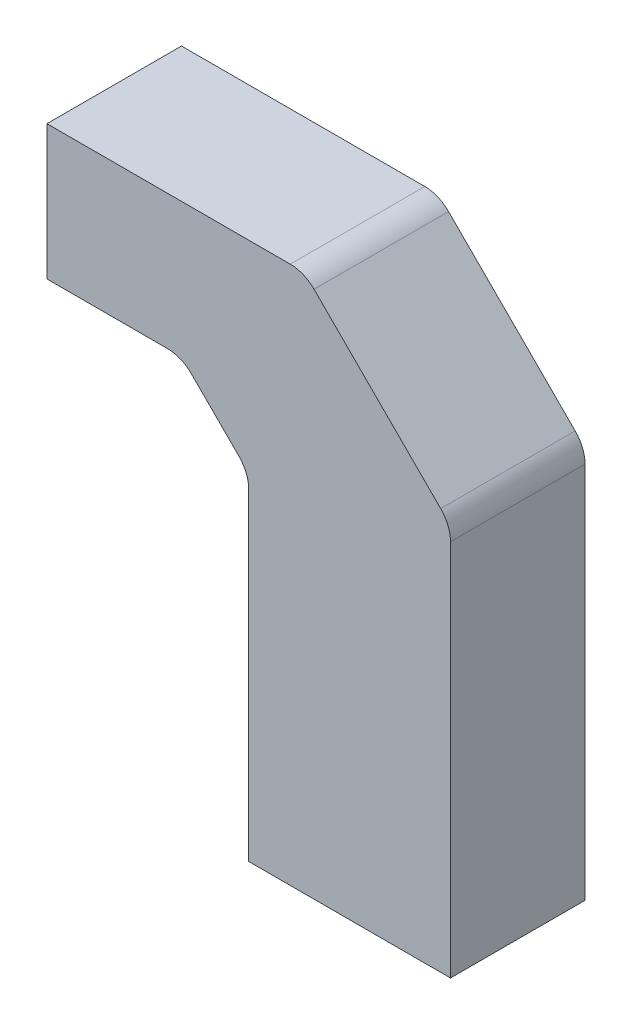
from build123d import *

# Parameters (mm, degrees)
EXTRUDE1_DEPTH     = 25.4
FILLET1_R          = 6.35
SKETCH2_R          = 6.35
CUT_EXTRUDE1_DEPTH = 25.4
SKETCH3_R          = 4.7625
CUT_EXTRUDE3_DEPTH = 5.08


with BuildPart() as part:
    # Sketch1 → Extrude1 (new body)
    with BuildSketch(Plane.XY):
        Polygon((-40.288446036, 57.569445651), (-40.288446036, 32.169445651), (-14.888446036, 32.169445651), (-2.188446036, 19.469445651), (-2.188446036, -44.030554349), (35.911553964, -44.030554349), (35.911553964, 29.938871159), (8.280979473, 57.569445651), align=None)
    extrude(amount=EXTRUDE1_DEPTH)

    # Fillet1
    fillet1_edges = [part.edges().sort_by_distance(p)[0] for p in [
        (8.280979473, 57.569445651, 12.7),
        (35.911553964, 29.938871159, 12.7),
        (-2.188446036, 19.469445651, 12.7),
        (-14.888446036, 32.169445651, 12.7),
    ]]
    fillet(fillet1_edges, radius=FILLET1_R)

    # Sketch2 → Cut-Extrude1 (cut)
    with BuildSketch(Plane.ZY.offset(40.288446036)):
        with Locations(Location((12.7, 44.869445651, 0), (0, 0, 270))):
            Circle(SKETCH2_R)
    extrude(amount=-CUT_EXTRUDE1_DEPTH, mode=Mode.SUBTRACT)

    # Sketch3 → Cut-Extrude3 (cut)
    with BuildSketch(Plane.XZ.offset(-32.169445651)):
        with Locations((-27.588446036, 12.7)):
            Circle(SKETCH3_R)
    extrude(amount=-CUT_EXTRUDE3_DEPTH, mode=Mode.SUBTRACT)


solid = part.part
